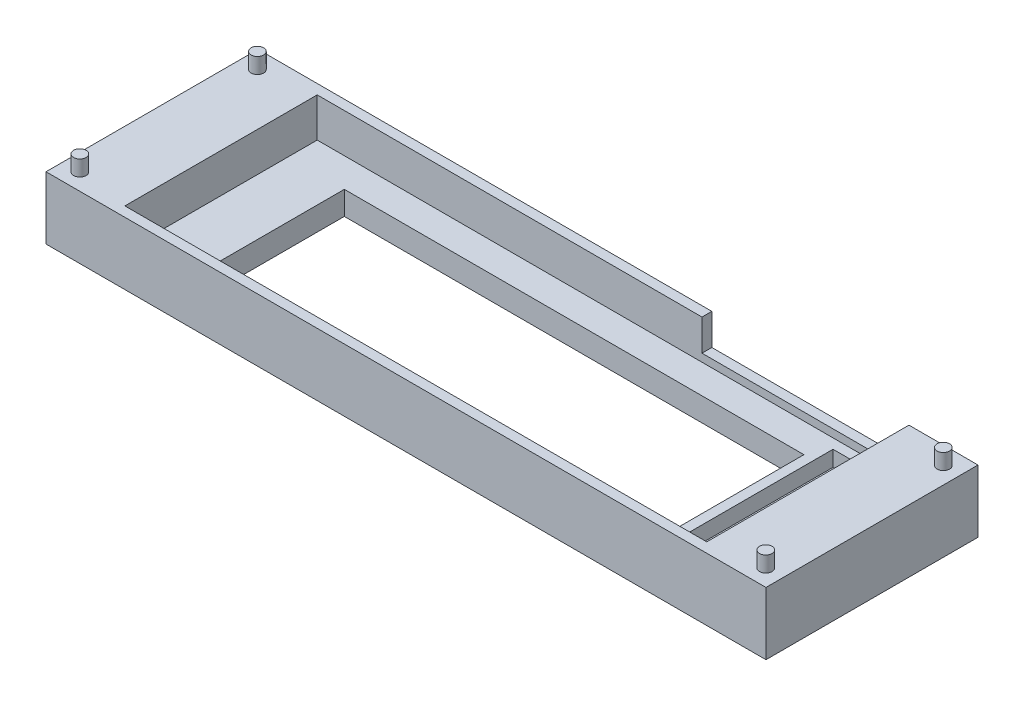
from build123d import *

# Parameters (mm, degrees)
SKETCH1_W               = 146
SKETCH1_H               = 43
SKETCH1_W_2             = 118
SKETCH1_H_2             = 39
BOSS_EXTRUDE1_DEPTH     = 6.35
CUT_EXTRUDE1_DEPTH      = 77.364733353
CUT_EXTRUDE1_DEPTH_BACK = 77.364733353
SKETCH2_W               = 39.975
SKETCH2_H               = 2
SKETCH3_R               = 1.27
BOSS_EXTRUDE2_DEPTH     = 3.175
SKETCH5_W               = 146
SKETCH5_H               = 43
SKETCH5_W_2             = 118
SKETCH5_H_2             = 39
BOSS_EXTRUDE3_DEPTH     = 1.5875
SKETCH6_W               = 146
SKETCH6_H               = 43
SKETCH6_W_2             = 93.2
SKETCH6_H_2             = 28
BOSS_EXTRUDE4_DEPTH     = 4.7625
SKETCH7_W               = 9.4
SKETCH7_H               = 35
CUT_EXTRUDE2_DEPTH      = 3.175


with BuildPart() as part:
    # Sketch1 → Boss-Extrude1 (new body)
    with BuildSketch(Plane(origin=(0, 0, 0), x_dir=(1, 0, 0), z_dir=(0, 1, 0))):
        Rectangle(SKETCH1_W, SKETCH1_H)
        Rectangle(SKETCH1_W_2, SKETCH1_H_2, mode=Mode.SUBTRACT)
    extrude(amount=BOSS_EXTRUDE1_DEPTH)

    # Sketch2 → Cut-Extrude1 (cut, two sides: drawn at the far end of the back side and taken through both)
    with BuildSketch(Plane(origin=(0, 6.35, 0), x_dir=(1, 0, 0), z_dir=(0, 1, 0)).offset(-CUT_EXTRUDE1_DEPTH_BACK)):
        with Locations((39.0125, 20.5)):
            Rectangle(SKETCH2_W, SKETCH2_H)
    extrude(amount=CUT_EXTRUDE1_DEPTH + CUT_EXTRUDE1_DEPTH_BACK, mode=Mode.SUBTRACT)

    # Sketch3 → Boss-Extrude2 (add)
    with BuildSketch(Plane(origin=(0, 6.35, 0), x_dir=(1, 0, 0), z_dir=(0, 1, 0))):
        with Locations(Location((-69.53, 17.9, 0), (0, 0, 270))):
            Circle(SKETCH3_R)
        with Locations(Location((-69.53, -18.1, 0), (0, 0, 270))):
            Circle(SKETCH3_R)
        with Locations(Location((69.57, -18.1, 0), (0, 0, 270))):
            Circle(SKETCH3_R)
        with Locations(Location((69.57, 17.9, 0), (0, 0, 270))):
            Circle(SKETCH3_R)
    extrude(amount=BOSS_EXTRUDE2_DEPTH)

    # Sketch5 → Boss-Extrude3 (add)
    with BuildSketch(Plane.XZ):
        Rectangle(SKETCH5_W, SKETCH5_H)
        Rectangle(SKETCH5_W_2, SKETCH5_H_2, mode=Mode.SUBTRACT)
    extrude(amount=BOSS_EXTRUDE3_DEPTH)

    # Sketch6 → Boss-Extrude4 (add)
    with BuildSketch(Plane.XZ.offset(1.5875)):
        Rectangle(SKETCH6_W, SKETCH6_H)
        with Locations((-1, 0.4)):
            Rectangle(SKETCH6_W_2, SKETCH6_H_2, mode=Mode.SUBTRACT)
    extrude(amount=BOSS_EXTRUDE4_DEPTH)

    # Sketch7 → Cut-Extrude2 (cut)
    with BuildSketch(Plane(origin=(0, -1.5875, 0), x_dir=(1, 0, 0), z_dir=(0, 1, 0))):
        with Locations((52.3, 0)):
            Rectangle(SKETCH7_W, SKETCH7_H)
    extrude(amount=-CUT_EXTRUDE2_DEPTH, mode=Mode.SUBTRACT)


solid = part.part
